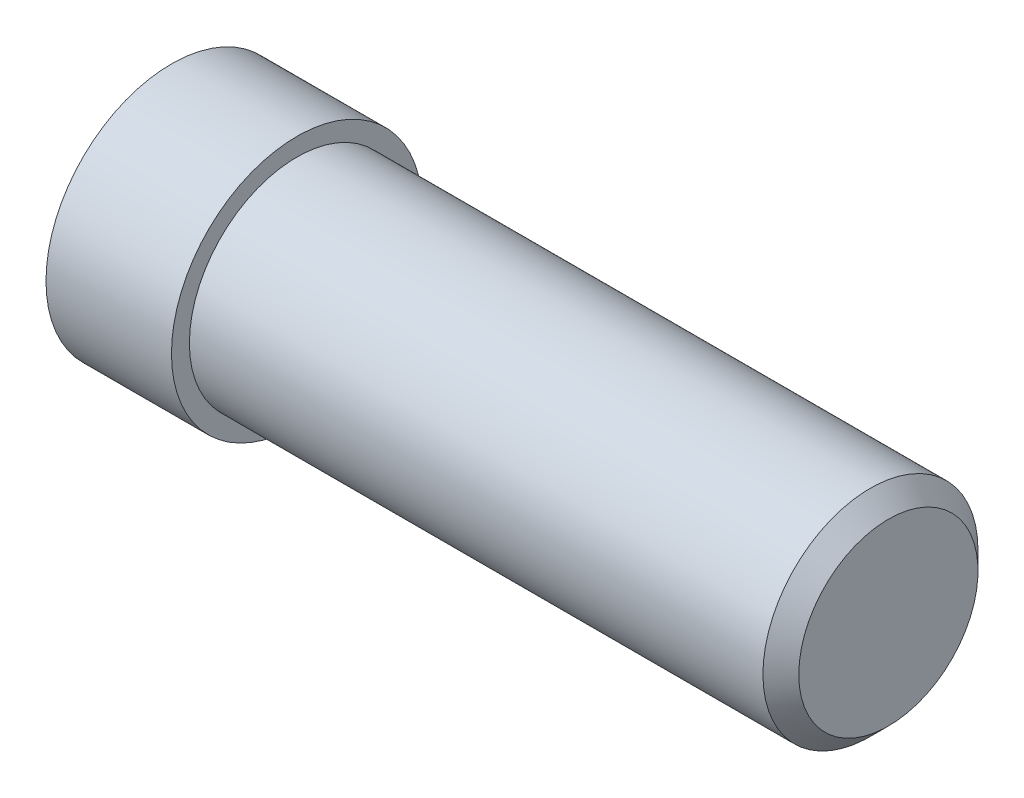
ISO-10303-21;
HEADER;
FILE_DESCRIPTION(('STEP AP214'),'2;1');
FILE_NAME('part.step','',(''),(''),'','','');
FILE_SCHEMA(('AUTOMOTIVE_DESIGN { 1 0 10303 214 1 1 1 1 }'));
ENDSEC;
DATA;
#1=APPLICATION_CONTEXT('core data for automotive mechanical design processes');
#2=APPLICATION_PROTOCOL_DEFINITION('international standard','automotive_design',2000,#1);
#3=PRODUCT_CONTEXT('',#1,'mechanical');
#4=PRODUCT('Part','Part','',(#3));
#5=PRODUCT_RELATED_PRODUCT_CATEGORY('part','',(#4));
#6=PRODUCT_DEFINITION_FORMATION('','',#4);
#7=PRODUCT_DEFINITION_CONTEXT('part definition',#1,'design');
#8=PRODUCT_DEFINITION('design','',#6,#7);
#9=PRODUCT_DEFINITION_SHAPE('','',#8);
#10=(LENGTH_UNIT() NAMED_UNIT(*) SI_UNIT(.MILLI.,.METRE.));
#11=(NAMED_UNIT(*) PLANE_ANGLE_UNIT() SI_UNIT($,.RADIAN.));
#12=(NAMED_UNIT(*) SI_UNIT($,.STERADIAN.) SOLID_ANGLE_UNIT());
#13=UNCERTAINTY_MEASURE_WITH_UNIT(LENGTH_MEASURE(1.E-05),#10,'distance_accuracy_value','');
#14=(GEOMETRIC_REPRESENTATION_CONTEXT(3) GLOBAL_UNCERTAINTY_ASSIGNED_CONTEXT((#13)) GLOBAL_UNIT_ASSIGNED_CONTEXT((#10,
#11,#12)) REPRESENTATION_CONTEXT('',''));
#15=CARTESIAN_POINT('',(0.,0.,0.));
#16=DIRECTION('',(0.,0.,1.));
#17=DIRECTION('',(1.,0.,0.));
#18=AXIS2_PLACEMENT_3D('',#15,#16,#17);
#19=CARTESIAN_POINT('',(-38.0652022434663,25.3601694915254,0.));
#20=DIRECTION('',(-1.,0.,0.));
#21=DIRECTION('',(0.,0.,1.));
#22=AXIS2_PLACEMENT_3D('',#19,#20,#21);
#23=PLANE('',#22);
#24=CARTESIAN_POINT('',(-38.0652022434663,20.1101694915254,0.));
#25=DIRECTION('',(-1.,0.,0.));
#26=DIRECTION('',(0.,0.,1.));
#27=AXIS2_PLACEMENT_3D('',#24,#25,#26);
#28=CIRCLE('',#27,5.25);
#29=CARTESIAN_POINT('',(-38.0652022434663,20.1101694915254,5.25));
#30=VERTEX_POINT('',#29);
#31=EDGE_CURVE('E51',#30,#30,#28,.T.);
#32=ORIENTED_EDGE('',*,*,#31,.F.);
#33=EDGE_LOOP('',(#32));
#34=FACE_BOUND('',#33,.T.);
#35=CARTESIAN_POINT('',(-38.0652022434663,20.1101694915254,0.));
#36=DIRECTION('',(-1.,0.,0.));
#37=DIRECTION('',(0.,0.,1.));
#38=AXIS2_PLACEMENT_3D('',#35,#36,#37);
#39=CIRCLE('',#38,4.5);
#40=CARTESIAN_POINT('',(-38.0652022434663,20.1101694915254,4.5));
#41=VERTEX_POINT('',#40);
#42=EDGE_CURVE('E62',#41,#41,#39,.T.);
#43=ORIENTED_EDGE('',*,*,#42,.T.);
#44=EDGE_LOOP('',(#43));
#45=FACE_BOUND('',#44,.T.);
#46=ADVANCED_FACE('F38',(#34,#45),#23,.F.);
#47=CARTESIAN_POINT('',(-43.9380835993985,20.1101694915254,0.));
#48=DIRECTION('',(-1.,0.,0.));
#49=DIRECTION('',(0.,0.,1.));
#50=AXIS2_PLACEMENT_3D('',#47,#48,#49);
#51=CYLINDRICAL_SURFACE('',#50,5.25);
#52=CARTESIAN_POINT('',(-43.3152022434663,20.1101694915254,0.));
#53=DIRECTION('',(-1.,0.,0.));
#54=DIRECTION('',(0.,0.,1.));
#55=AXIS2_PLACEMENT_3D('',#52,#53,#54);
#56=CIRCLE('',#55,5.25);
#57=CARTESIAN_POINT('',(-43.3152022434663,20.1101694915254,5.25));
#58=VERTEX_POINT('',#57);
#59=EDGE_CURVE('E56',#58,#58,#56,.T.);
#60=ORIENTED_EDGE('',*,*,#59,.F.);
#61=EDGE_LOOP('',(#60));
#62=FACE_BOUND('',#61,.T.);
#63=ORIENTED_EDGE('',*,*,#31,.T.);
#64=EDGE_LOOP('',(#63));
#65=FACE_BOUND('',#64,.T.);
#66=ADVANCED_FACE('F80',(#62,#65),#51,.T.);
#67=CARTESIAN_POINT('',(-43.3152022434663,25.3601694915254,0.));
#68=DIRECTION('',(1.,0.,0.));
#69=DIRECTION('',(0.,0.,-1.));
#70=AXIS2_PLACEMENT_3D('',#67,#68,#69);
#71=PLANE('',#70);
#72=ORIENTED_EDGE('',*,*,#59,.T.);
#73=EDGE_LOOP('',(#72));
#74=FACE_BOUND('',#73,.T.);
#75=ADVANCED_FACE('F77',(#74),#71,.F.);
#76=CARTESIAN_POINT('',(-13.3152022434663,24.6101694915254,0.));
#77=DIRECTION('',(-1.,0.,0.));
#78=DIRECTION('',(0.,0.,1.));
#79=AXIS2_PLACEMENT_3D('',#76,#77,#78);
#80=PLANE('',#79);
#81=CARTESIAN_POINT('',(-13.3152022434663,20.1101694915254,0.));
#82=DIRECTION('',(-1.,0.,0.));
#83=DIRECTION('',(0.,0.,1.));
#84=AXIS2_PLACEMENT_3D('',#81,#82,#83);
#85=CIRCLE('',#84,3.74999999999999);
#86=CARTESIAN_POINT('',(-13.3152022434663,20.1101694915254,3.74999999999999));
#87=VERTEX_POINT('',#86);
#88=EDGE_CURVE('E10',#87,#87,#85,.F.);
#89=ORIENTED_EDGE('',*,*,#88,.T.);
#90=EDGE_LOOP('',(#89));
#91=FACE_BOUND('',#90,.T.);
#92=ADVANCED_FACE('F70',(#91),#80,.F.);
#93=CARTESIAN_POINT('',(-43.9380835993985,20.1101694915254,0.));
#94=DIRECTION('',(-1.,0.,0.));
#95=DIRECTION('',(0.,0.,1.));
#96=AXIS2_PLACEMENT_3D('',#93,#94,#95);
#97=CYLINDRICAL_SURFACE('',#96,4.5);
#98=CARTESIAN_POINT('',(-14.0652022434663,20.1101694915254,0.));
#99=DIRECTION('',(-1.,0.,0.));
#100=DIRECTION('',(0.,0.,1.));
#101=AXIS2_PLACEMENT_3D('',#98,#99,#100);
#102=CIRCLE('',#101,4.5);
#103=CARTESIAN_POINT('',(-14.0652022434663,20.1101694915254,4.5));
#104=VERTEX_POINT('',#103);
#105=EDGE_CURVE('E46',#104,#104,#102,.T.);
#106=ORIENTED_EDGE('',*,*,#105,.T.);
#107=EDGE_LOOP('',(#106));
#108=FACE_BOUND('',#107,.T.);
#109=ORIENTED_EDGE('',*,*,#42,.F.);
#110=EDGE_LOOP('',(#109));
#111=FACE_BOUND('',#110,.T.);
#112=ADVANCED_FACE('F68',(#108,#111),#97,.T.);
#113=CARTESIAN_POINT('',(-14.0652022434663,20.1101694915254,0.));
#114=DIRECTION('',(-1.,0.,0.));
#115=DIRECTION('',(0.,0.,1.));
#116=AXIS2_PLACEMENT_3D('',#113,#114,#115);
#117=CONICAL_SURFACE('',#116,4.5,0.785398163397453);
#118=ORIENTED_EDGE('',*,*,#88,.F.);
#119=EDGE_LOOP('',(#118));
#120=FACE_BOUND('',#119,.T.);
#121=ORIENTED_EDGE('',*,*,#105,.F.);
#122=EDGE_LOOP('',(#121));
#123=FACE_BOUND('',#122,.T.);
#124=ADVANCED_FACE('F40',(#120,#123),#117,.T.);
#125=CLOSED_SHELL('',(#46,#66,#75,#92,#112,#124));
#126=MANIFOLD_SOLID_BREP('B2',#125);
#127=ADVANCED_BREP_SHAPE_REPRESENTATION('',(#18,#126),#14);
#128=SHAPE_DEFINITION_REPRESENTATION(#9,#127);
ENDSEC;
END-ISO-10303-21;
